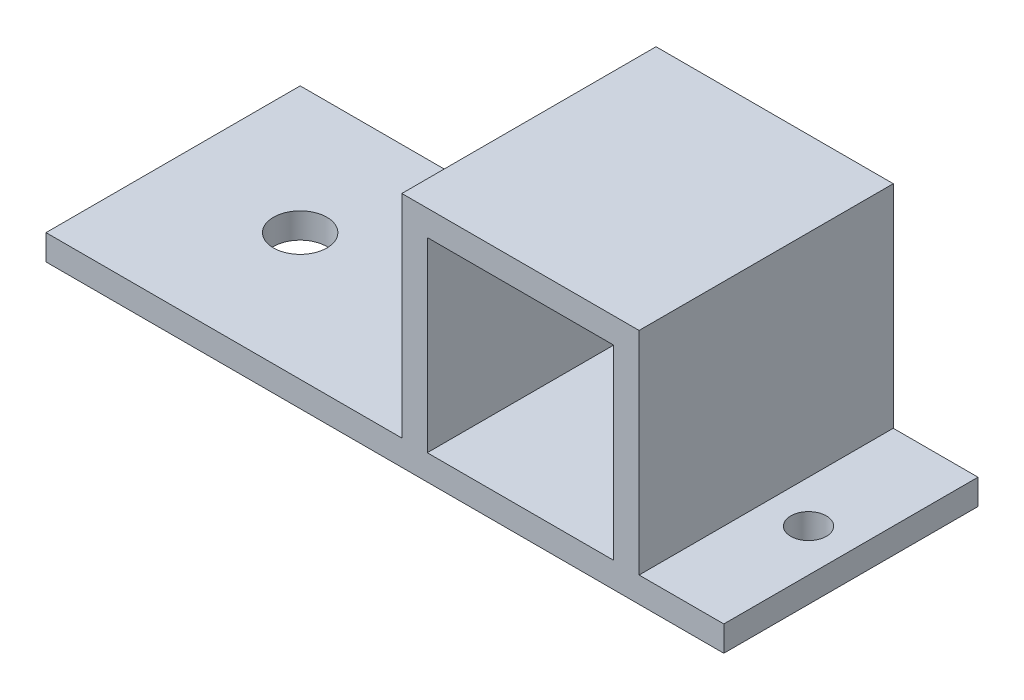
from build123d import *

# Parameters (mm, degrees)
SKETCH3_W           = 80
SKETCH3_H           = 3
BOSS_EXTRUDE1_DEPTH = 15
SKETCH4_W           = 28
SKETCH4_H           = 30
BOSS_EXTRUDE2_DEPTH = 25
SKETCH5_W           = 22
SKETCH5_H           = 22
CUT_EXTRUDE1_DEPTH  = 57.588426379
SKETCH6_R           = 2.1
CUT_EXTRUDE2_DEPTH  = 50.497474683
SKETCH7_R           = 3.15
CUT_EXTRUDE3_DEPTH  = 50.497474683


with BuildPart() as part:
    # Sketch3 → Boss-Extrude1 (new, symmetric)
    with BuildSketch(Plane.XY):
        Rectangle(SKETCH3_W, SKETCH3_H)
    extrude(amount=BOSS_EXTRUDE1_DEPTH, both=True)

    # Sketch4 → Boss-Extrude2 (add)
    with BuildSketch(Plane(origin=(0, 1.5, 0), x_dir=(1, 0, 0), z_dir=(0, 1, 0))):
        with Locations((16, 0)):
            Rectangle(SKETCH4_W, SKETCH4_H)
    extrude(amount=BOSS_EXTRUDE2_DEPTH)

    # Sketch5 → Cut-Extrude1 (cut, through all)
    with BuildSketch(Plane.XY.offset(15)):
        with Locations((16, 12.5)):
            Rectangle(SKETCH5_W, SKETCH5_H)
    extrude(amount=-CUT_EXTRUDE1_DEPTH, mode=Mode.SUBTRACT)

    # Sketch6 → Cut-Extrude2 (cut, through all)
    with BuildSketch(Plane(origin=(0, 1.5, 0), x_dir=(1, 0, 0), z_dir=(0, 1, 0))):
        with Locations(Location((35, 0, 0), (0, 0, 270))):
            Circle(SKETCH6_R)
    extrude(amount=-CUT_EXTRUDE2_DEPTH, mode=Mode.SUBTRACT)

    # Sketch7 → Cut-Extrude3 (cut, through all)
    with BuildSketch(Plane(origin=(0, 1.5, 0), x_dir=(1, 0, 0), z_dir=(0, 1, 0))):
        with Locations(Location((-25, 0, 0), (0, 0, 270))):
            Circle(SKETCH7_R)
    extrude(amount=-CUT_EXTRUDE3_DEPTH, mode=Mode.SUBTRACT)


solid = part.part
